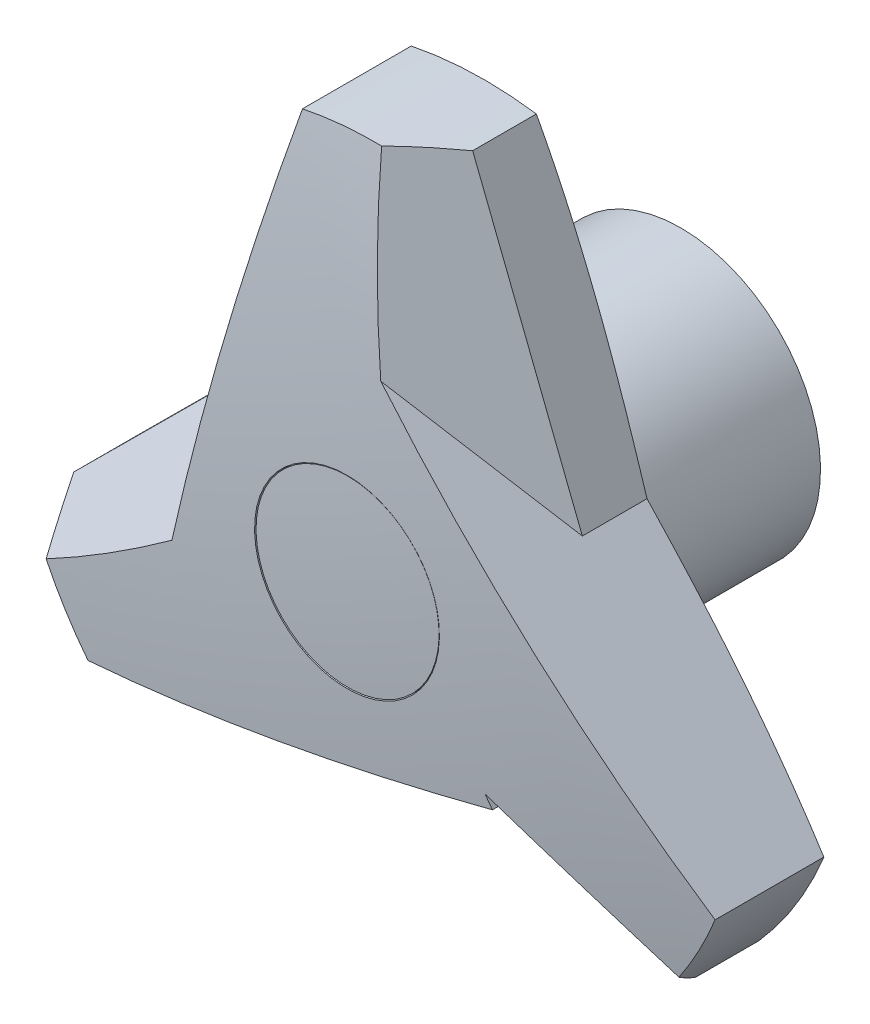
ISO-10303-21;
HEADER;
FILE_DESCRIPTION(('STEP AP214'),'2;1');
FILE_NAME('part.step','',(''),(''),'','','');
FILE_SCHEMA(('AUTOMOTIVE_DESIGN { 1 0 10303 214 1 1 1 1 }'));
ENDSEC;
DATA;
#1=APPLICATION_CONTEXT('core data for automotive mechanical design processes');
#2=APPLICATION_PROTOCOL_DEFINITION('international standard','automotive_design',2000,#1);
#3=PRODUCT_CONTEXT('',#1,'mechanical');
#4=PRODUCT('Part','Part','',(#3));
#5=PRODUCT_RELATED_PRODUCT_CATEGORY('part','',(#4));
#6=PRODUCT_DEFINITION_FORMATION('','',#4);
#7=PRODUCT_DEFINITION_CONTEXT('part definition',#1,'design');
#8=PRODUCT_DEFINITION('design','',#6,#7);
#9=PRODUCT_DEFINITION_SHAPE('','',#8);
#10=(LENGTH_UNIT() NAMED_UNIT(*) SI_UNIT(.MILLI.,.METRE.));
#11=(NAMED_UNIT(*) PLANE_ANGLE_UNIT() SI_UNIT($,.RADIAN.));
#12=(NAMED_UNIT(*) SI_UNIT($,.STERADIAN.) SOLID_ANGLE_UNIT());
#13=UNCERTAINTY_MEASURE_WITH_UNIT(LENGTH_MEASURE(1.E-05),#10,'distance_accuracy_value','');
#14=(GEOMETRIC_REPRESENTATION_CONTEXT(3) GLOBAL_UNCERTAINTY_ASSIGNED_CONTEXT((#13)) GLOBAL_UNIT_ASSIGNED_CONTEXT((#10,
#11,#12)) REPRESENTATION_CONTEXT('',''));
#15=CARTESIAN_POINT('',(0.,0.,0.));
#16=DIRECTION('',(0.,0.,1.));
#17=DIRECTION('',(1.,0.,0.));
#18=AXIS2_PLACEMENT_3D('',#15,#16,#17);
#19=CARTESIAN_POINT('',(0.,0.,199.590651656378));
#20=DIRECTION('',(0.,0.,-1.));
#21=DIRECTION('',(0.,1.,0.));
#22=AXIS2_PLACEMENT_3D('',#19,#20,#21);
#23=DEGENERATE_TOROIDAL_SURFACE('',#22,12.1325115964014,179.999999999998,.T.);
#24=CARTESIAN_POINT('',(0.,0.,21.7609491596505));
#25=DIRECTION('',(0.,0.,1.));
#26=DIRECTION('',(0.,-1.,0.));
#27=AXIS2_PLACEMENT_3D('',#24,#25,#26);
#28=CIRCLE('',#27,40.);
#29=CARTESIAN_POINT('',(5.66240415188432,39.5971865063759,21.7609491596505));
#30=VERTEX_POINT('',#29);
#31=CARTESIAN_POINT('',(-8.00833046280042,39.1901345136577,21.7609491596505));
#32=VERTEX_POINT('',#31);
#33=EDGE_CURVE('E116',#30,#32,#28,.T.);
#34=ORIENTED_EDGE('',*,*,#33,.F.);
#35=CARTESIAN_POINT('',(15.6512103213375,7.13356645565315,19.662004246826));
#36=CARTESIAN_POINT('',(15.4401686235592,7.8194519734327,19.6646388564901));
#37=CARTESIAN_POINT('',(15.2291275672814,8.50533540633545,19.6685241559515));
#38=CARTESIAN_POINT('',(14.8070497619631,9.87708827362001,19.6793435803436));
#39=CARTESIAN_POINT('',(14.5960130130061,10.5629577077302,19.6862777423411));
#40=CARTESIAN_POINT('',(14.1739312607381,11.9347234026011,19.7037431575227));
#41=CARTESIAN_POINT('',(13.9628862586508,12.6206196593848,19.7142747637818));
#42=CARTESIAN_POINT('',(13.540818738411,13.9923391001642,19.7396036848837));
#43=CARTESIAN_POINT('',(13.3297962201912,14.6781622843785,19.7544009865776));
#44=CARTESIAN_POINT('',(12.908133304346,16.0485667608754,19.7888864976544));
#45=CARTESIAN_POINT('',(12.6974928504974,16.7331482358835,19.8085666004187));
#46=CARTESIAN_POINT('',(12.2762631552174,18.1021447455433,19.8534225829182));
#47=CARTESIAN_POINT('',(12.0656739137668,18.7865597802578,19.8785984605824));
#48=CARTESIAN_POINT('',(11.4340161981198,20.8394473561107,19.9631760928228));
#49=CARTESIAN_POINT('',(11.0130466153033,22.2075985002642,20.0316286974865));
#50=CARTESIAN_POINT('',(10.3164758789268,24.4714533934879,20.1675775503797));
#51=CARTESIAN_POINT('',(10.0407419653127,25.3675886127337,20.2272837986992));
#52=CARTESIAN_POINT('',(9.48953016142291,27.1590269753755,20.359048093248));
#53=CARTESIAN_POINT('',(9.21405227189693,28.054330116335,20.4311061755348));
#54=CARTESIAN_POINT('',(8.38808305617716,30.7387300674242,20.6665756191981));
#55=CARTESIAN_POINT('',(7.83804915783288,32.5263402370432,20.8492835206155));
#56=CARTESIAN_POINT('',(7.01378032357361,35.2052139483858,21.164017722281));
#57=CARTESIAN_POINT('',(6.73886374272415,36.0986928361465,21.2758478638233));
#58=CARTESIAN_POINT('',(6.18954079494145,37.8839924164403,21.51322997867));
#59=CARTESIAN_POINT('',(5.91513442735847,38.775813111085,21.6387819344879));
#60=CARTESIAN_POINT('',(5.36688101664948,40.5576366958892,21.9037708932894));
#61=CARTESIAN_POINT('',(5.09303401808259,41.4476394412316,22.0432089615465));
#62=CARTESIAN_POINT('',(4.54598520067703,43.2255480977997,22.3360608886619));
#63=CARTESIAN_POINT('',(4.2727833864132,44.1134539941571,22.489474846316));
#64=CARTESIAN_POINT('',(3.99993846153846,45.0002,22.6499251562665));
#65=B_SPLINE_CURVE_WITH_KNOTS('',3,(#35,#36,#37,#38,#39,#40,#41,#42,#43,#44,#45,#46,#47,#48,#49,
#50,#51,#52,#53,#54,#55,#56,#57,#58,#59,#60,#61,#62,#63,#64),.UNSPECIFIED.,.F.,.F.,(4,2,2,2,2,2,
2,2,2,2,2,2,2,2,4),(0.,2.15287507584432,4.30577632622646,6.45888893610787,8.61199490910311,
10.7615498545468,12.9111039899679,17.2100988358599,20.0285093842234,22.846928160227,
28.4836939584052,31.308063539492,34.1324295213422,36.9570123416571,39.7816151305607),.UNSPECIFIED.);
#66=CARTESIAN_POINT('',(15.6511487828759,7.13376645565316,19.6620050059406));
#67=VERTEX_POINT('',#66);
#68=EDGE_CURVE('E132',#67,#30,#65,.T.);
#69=ORIENTED_EDGE('',*,*,#68,.F.);
#70=CARTESIAN_POINT('',(40.9713431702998,-19.0361050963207,22.6499391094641));
#71=CARTESIAN_POINT('',(40.3665233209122,-18.4109891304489,22.4983062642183));
#72=CARTESIAN_POINT('',(39.7609596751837,-17.785104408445,22.3528792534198));
#73=CARTESIAN_POINT('',(38.5484646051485,-16.5319212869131,22.0743693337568));
#74=CARTESIAN_POINT('',(37.9415331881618,-15.9046228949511,21.9412863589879));
#75=CARTESIAN_POINT('',(36.1189517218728,-14.0208805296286,21.5604695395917));
#76=CARTESIAN_POINT('',(34.9014204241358,-12.7624921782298,21.3311442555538));
#77=CARTESIAN_POINT('',(32.464670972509,-10.2439720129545,20.9210416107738));
#78=CARTESIAN_POINT('',(31.24545992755,-8.98384754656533,20.7401766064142));
#79=CARTESIAN_POINT('',(29.4145124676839,-7.09145844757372,20.5035597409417));
#80=CARTESIAN_POINT('',(28.8038351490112,-6.46028845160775,20.4304669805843));
#81=CARTESIAN_POINT('',(27.5818825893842,-5.19733047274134,20.2954943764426));
#82=CARTESIAN_POINT('',(26.9706073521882,-4.56554249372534,20.2336144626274));
#83=CARTESIAN_POINT('',(25.7490545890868,-3.30299772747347,20.1207675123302));
#84=CARTESIAN_POINT('',(25.1387782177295,-2.67224213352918,20.069774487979));
#85=CARTESIAN_POINT('',(23.9178580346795,-1.41035117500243,19.9779346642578));
#86=CARTESIAN_POINT('',(23.3072142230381,-0.779215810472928,19.9370878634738));
#87=CARTESIAN_POINT('',(22.0856544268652,0.483336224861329,19.8647872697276));
#88=CARTESIAN_POINT('',(21.4747384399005,1.11475289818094,19.8333335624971));
#89=CARTESIAN_POINT('',(20.2527270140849,2.37777171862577,19.7788579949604));
#90=CARTESIAN_POINT('',(19.6416315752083,3.0093738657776,19.7558361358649));
#91=CARTESIAN_POINT('',(18.4191107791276,4.27291914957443,19.7170407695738));
#92=CARTESIAN_POINT('',(17.8076853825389,4.90486232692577,19.7012698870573));
#93=CARTESIAN_POINT('',(16.584775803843,6.16880943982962,19.67565248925));
#94=CARTESIAN_POINT('',(15.9732916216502,6.80081337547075,19.6658059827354));
#95=CARTESIAN_POINT('',(14.7503004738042,8.06484479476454,19.65071439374));
#96=CARTESIAN_POINT('',(14.1387935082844,8.69687227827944,19.6454692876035));
#97=CARTESIAN_POINT('',(12.9157713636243,9.96093573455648,19.6385540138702));
#98=CARTESIAN_POINT('',(12.3042561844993,10.5929717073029,19.63688384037));
#99=CARTESIAN_POINT('',(11.3320063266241,11.5978476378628,19.6367673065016));
#100=CARTESIAN_POINT('',(10.9712715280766,11.9706877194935,19.6372797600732));
#101=CARTESIAN_POINT('',(10.249805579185,12.7163641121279,19.6394704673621));
#102=CARTESIAN_POINT('',(9.88907442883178,13.089200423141,19.641148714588));
#103=CARTESIAN_POINT('',(9.16766569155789,13.8348176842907,19.6457974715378));
#104=CARTESIAN_POINT('',(8.80698810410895,14.2075986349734,19.6487678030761));
#105=CARTESIAN_POINT('',(8.08563989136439,14.9531533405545,19.6562018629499));
#106=CARTESIAN_POINT('',(7.72496926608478,15.3259270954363,19.6606655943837));
#107=CARTESIAN_POINT('',(6.64241534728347,16.4448085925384,19.6766781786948));
#108=CARTESIAN_POINT('',(5.92054808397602,17.1908997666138,19.6908455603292));
#109=CARTESIAN_POINT('',(4.47681743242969,18.6830781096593,19.7283493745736));
#110=CARTESIAN_POINT('',(3.75495406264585,19.429165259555,19.751687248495));
#111=CARTESIAN_POINT('',(3.03318673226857,20.1751531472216,19.7807036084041));
#112=B_SPLINE_CURVE_WITH_KNOTS('',3,(#70,#71,#72,#73,#74,#75,#76,#77,#78,#79,#80,#81,#82,#83,
#84,#85,#86,#87,#88,#89,#90,#91,#92,#93,#94,#95,#96,#97,#98,#99,#100,#101,#102,#103,#104,#105,
#106,#107,#108,#109,#110,#111),.UNSPECIFIED.,.F.,.F.,(4,2,2,2,2,2,2,2,2,2,2,2,2,2,2,2,2,2,2,2,
4),(0.,2.64875141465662,5.29748868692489,10.5945515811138,15.881968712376,18.5257321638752,
21.1694791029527,23.806842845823,26.4442062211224,29.0815936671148,31.7189814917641,
34.3573232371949,36.9956688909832,39.634000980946,42.2723287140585,43.8286875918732,
45.3850378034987,46.9411734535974,48.4973123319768,51.6119978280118,54.7271730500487),.UNSPECIFIED.);
#113=CARTESIAN_POINT('',(37.0766539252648,-15.0107206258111,21.7609491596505));
#114=VERTEX_POINT('',#113);
#115=EDGE_CURVE('E131',#114,#67,#112,.T.);
#116=ORIENTED_EDGE('',*,*,#115,.F.);
#117=CARTESIAN_POINT('',(30.01202420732,-26.4438726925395,21.7609491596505));
#118=VERTEX_POINT('',#117);
#119=EDGE_CURVE('E23',#118,#114,#28,.T.);
#120=ORIENTED_EDGE('',*,*,#119,.F.);
#121=CARTESIAN_POINT('',(0.24616999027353,-17.6571983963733,19.6755081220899));
#122=CARTESIAN_POINT('',(0.952943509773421,-17.8658330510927,19.6822269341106));
#123=CARTESIAN_POINT('',(1.65970623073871,-18.0744645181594,19.6906171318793));
#124=CARTESIAN_POINT('',(3.07318774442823,-18.4917144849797,19.7114702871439));
#125=CARTESIAN_POINT('',(3.77990653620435,-18.7003329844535,19.7239333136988));
#126=CARTESIAN_POINT('',(5.19333378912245,-19.1175669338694,19.7536636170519));
#127=CARTESIAN_POINT('',(5.90004224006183,-19.3261823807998,19.7709314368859));
#128=CARTESIAN_POINT('',(7.31331115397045,-19.7433695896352,19.8109658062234));
#129=CARTESIAN_POINT('',(8.01987161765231,-19.9519413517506,19.8337323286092));
#130=CARTESIAN_POINT('',(10.1367780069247,-20.5768374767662,19.9111462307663));
#131=CARTESIAN_POINT('',(11.546833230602,-20.9930760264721,19.9749556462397));
#132=CARTESIAN_POINT('',(14.3654677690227,-21.8251174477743,20.1308457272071));
#133=CARTESIAN_POINT('',(15.7740471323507,-22.2409203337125,20.2229254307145));
#134=CARTESIAN_POINT('',(18.7331430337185,-23.1144249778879,20.4488258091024));
#135=CARTESIAN_POINT('',(20.2834301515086,-23.5720590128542,20.585954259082));
#136=CARTESIAN_POINT('',(23.3803585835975,-24.4862508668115,20.8996401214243));
#137=CARTESIAN_POINT('',(24.9269998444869,-24.9428086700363,21.0761981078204));
#138=CARTESIAN_POINT('',(28.0184621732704,-25.8553869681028,21.4703451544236));
#139=CARTESIAN_POINT('',(29.5632742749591,-26.3114048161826,21.6880111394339));
#140=CARTESIAN_POINT('',(31.8760480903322,-26.994119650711,22.0456557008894));
#141=CARTESIAN_POINT('',(32.6462498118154,-27.2214778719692,22.1700647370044));
#142=CARTESIAN_POINT('',(34.1850389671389,-27.6757177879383,22.4293188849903));
#143=CARTESIAN_POINT('',(34.953626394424,-27.9025994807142,22.5641640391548));
#144=CARTESIAN_POINT('',(35.7213431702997,-28.1292241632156,22.7042542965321));
#145=B_SPLINE_CURVE_WITH_KNOTS('',3,(#121,#122,#123,#124,#125,#126,#127,#128,#129,#130,#131,
#132,#133,#134,#135,#136,#137,#138,#139,#140,#141,#142,#143,#144),.UNSPECIFIED.,.F.,.F.,(4,2,2,
2,2,2,2,2,2,2,2,4),(0.,2.21086830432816,4.42177409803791,6.63292986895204,8.84407473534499,
13.2585931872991,17.6729614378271,22.5391730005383,27.4054554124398,32.2809359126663,
34.7187894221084,37.1566528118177),.UNSPECIFIED.);
#146=CARTESIAN_POINT('',(0.24636999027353,-17.6572574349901,19.6755100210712));
#147=VERTEX_POINT('',#146);
#148=EDGE_CURVE('E129',#147,#118,#145,.T.);
#149=ORIENTED_EDGE('',*,*,#148,.F.);
#150=CARTESIAN_POINT('',(-36.9713431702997,-25.9641462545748,22.6499243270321));
#151=CARTESIAN_POINT('',(-36.0494174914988,-25.7583750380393,22.4869301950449));
#152=CARTESIAN_POINT('',(-35.1262668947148,-25.5523304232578,22.331223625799));
#153=CARTESIAN_POINT('',(-33.2777590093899,-25.139748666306,22.0342783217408));
#154=CARTESIAN_POINT('',(-32.352401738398,-24.9332115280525,21.8930394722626));
#155=CARTESIAN_POINT('',(-30.4997864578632,-24.519713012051,21.6249309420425));
#156=CARTESIAN_POINT('',(-29.5725286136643,-24.3127516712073,21.4980600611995));
#157=CARTESIAN_POINT('',(-27.7162677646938,-23.8984394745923,21.258510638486));
#158=CARTESIAN_POINT('',(-26.7872647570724,-23.6910886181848,21.14583211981));
#159=CARTESIAN_POINT('',(-24.9294076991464,-23.2764201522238,20.934637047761));
#160=CARTESIAN_POINT('',(-24.0005563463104,-23.0691031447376,20.8360955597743));
#161=CARTESIAN_POINT('',(-22.1415722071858,-22.6541831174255,20.6526398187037));
#162=CARTESIAN_POINT('',(-21.2114394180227,-22.446580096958,20.5677255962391));
#163=CARTESIAN_POINT('',(-19.3501244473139,-22.031139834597,20.4111280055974));
#164=CARTESIAN_POINT('',(-18.4189422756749,-21.8233025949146,20.3394445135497));
#165=CARTESIAN_POINT('',(-16.5557324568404,-21.4074394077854,20.2087759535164));
#166=CARTESIAN_POINT('',(-15.6237048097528,-21.1994134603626,20.1497908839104));
#167=CARTESIAN_POINT('',(-13.7615093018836,-20.7837766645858,20.0439561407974));
#168=CARTESIAN_POINT('',(-12.8313431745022,-20.5761662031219,19.997074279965));
#169=CARTESIAN_POINT('',(-10.9705482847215,-20.1608420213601,19.9143245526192));
#170=CARTESIAN_POINT('',(-10.0399195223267,-19.9531283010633,19.8784566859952));
#171=CARTESIAN_POINT('',(-8.17832924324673,-19.5376265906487,19.816573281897));
#172=CARTESIAN_POINT('',(-7.24736771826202,-19.3298385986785,19.7905580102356));
#173=CARTESIAN_POINT('',(-5.38525964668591,-18.9142213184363,19.7469845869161));
#174=CARTESIAN_POINT('',(-4.45411309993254,-18.7063920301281,19.7294264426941));
#175=CARTESIAN_POINT('',(-2.59141797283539,-18.2906437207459,19.7012365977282));
#176=CARTESIAN_POINT('',(-1.65986936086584,-18.0827246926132,19.6906071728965));
#177=CARTESIAN_POINT('',(0.203271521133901,-17.6668768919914,19.6748789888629));
#178=CARTESIAN_POINT('',(1.13486379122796,-17.4589481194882,19.6697802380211));
#179=CARTESIAN_POINT('',(2.99803990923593,-17.0430924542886,19.6642045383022));
#180=CARTESIAN_POINT('',(3.92962375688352,-16.8351655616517,19.6637274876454));
#181=CARTESIAN_POINT('',(5.79278090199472,-16.4193141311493,19.667296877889));
#182=CARTESIAN_POINT('',(6.72435419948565,-16.2113895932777,19.6713433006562));
#183=CARTESIAN_POINT('',(7.9700728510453,-15.9333486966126,19.680287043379));
#184=CARTESIAN_POINT('',(8.2842348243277,-15.8632286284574,19.6828430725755));
#185=CARTESIAN_POINT('',(8.91255254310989,-15.7229898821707,19.6886064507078));
#186=CARTESIAN_POINT('',(9.22670828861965,-15.6528712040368,19.6918137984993));
#187=CARTESIAN_POINT('',(10.1691070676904,-15.4425304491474,19.7024849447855));
#188=CARTESIAN_POINT('',(10.7973392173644,-15.3023108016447,19.7109982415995));
#189=CARTESIAN_POINT('',(12.0540495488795,-15.0218165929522,19.7312785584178));
#190=CARTESIAN_POINT('',(12.6825277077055,-14.8815420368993,19.743047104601));
#191=CARTESIAN_POINT('',(13.9394722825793,-14.6009955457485,19.770301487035));
#192=CARTESIAN_POINT('',(14.5679386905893,-14.4607236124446,19.7857877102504));
#193=CARTESIAN_POINT('',(15.1963524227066,-14.3204634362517,19.8033642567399));
#194=B_SPLINE_CURVE_WITH_KNOTS('',3,(#150,#151,#152,#153,#154,#155,#156,#157,#158,#159,#160,
#161,#162,#163,#164,#165,#166,#167,#168,#169,#170,#171,#172,#173,#174,#175,#176,#177,#178,#179,
#180,#181,#182,#183,#184,#185,#186,#187,#188,#189,#190,#191,#192,#193),.UNSPECIFIED.,.F.,.F.,(4,
2,2,2,2,2,2,2,2,2,2,2,2,2,2,2,2,2,2,2,2,4),(0.,2.87567705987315,5.75133132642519,
8.62674522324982,11.5021638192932,14.3724467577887,17.2427361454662,20.1129986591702,
22.9832608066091,25.8458092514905,28.7083576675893,31.5709833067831,34.4336114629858,
37.2971794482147,40.1607517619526,43.0242610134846,45.8877587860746,46.8534652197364,
47.8191699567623,49.750402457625,51.6825419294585,53.6148826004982),.UNSPECIFIED.);
#195=CARTESIAN_POINT('',(-31.4396613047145,-24.7294904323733,21.7609491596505));
#196=VERTEX_POINT('',#195);
#197=EDGE_CURVE('E121',#196,#147,#194,.T.);
#198=ORIENTED_EDGE('',*,*,#197,.F.);
#199=CARTESIAN_POINT('',(-37.9539072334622,-12.62936758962,21.7609491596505));
#200=VERTEX_POINT('',#199);
#201=EDGE_CURVE('E107',#200,#196,#28,.T.);
#202=ORIENTED_EDGE('',*,*,#201,.F.);
#203=CARTESIAN_POINT('',(-15.7252762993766,9.46503082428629,19.6982047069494));
#204=CARTESIAN_POINT('',(-16.8118399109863,8.38502866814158,19.7111482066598));
#205=CARTESIAN_POINT('',(-17.8984171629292,7.30501295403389,19.7313884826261));
#206=CARTESIAN_POINT('',(-20.0714174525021,5.1451348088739,19.7921582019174));
#207=CARTESIAN_POINT('',(-21.157840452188,4.06527241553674,19.8326902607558));
#208=CARTESIAN_POINT('',(-23.3281246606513,1.90809394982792,19.9396428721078));
#209=CARTESIAN_POINT('',(-24.4119869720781,0.830776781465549,20.0060169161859));
#210=CARTESIAN_POINT('',(-26.5785433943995,-1.3226964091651,20.1688513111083));
#211=CARTESIAN_POINT('',(-27.6612375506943,-2.39885247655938,20.2653104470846));
#212=CARTESIAN_POINT('',(-29.8709603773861,-4.59523140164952,20.4959357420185));
#213=CARTESIAN_POINT('',(-30.9979146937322,-5.7153803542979,20.6315320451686));
#214=CARTESIAN_POINT('',(-33.2492333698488,-7.95310394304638,20.9405112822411));
#215=CARTESIAN_POINT('',(-34.3735976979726,-9.07067854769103,21.1138946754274));
#216=CARTESIAN_POINT('',(-36.621020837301,-11.3045301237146,21.5000504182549));
#217=CARTESIAN_POINT('',(-37.7440735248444,-12.4208010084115,21.7128940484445));
#218=CARTESIAN_POINT('',(-39.4255164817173,-14.092090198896,22.062105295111));
#219=CARTESIAN_POINT('',(-39.9854881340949,-14.6486803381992,22.1835032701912));
#220=CARTESIAN_POINT('',(-41.1042923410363,-15.7607283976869,22.4363398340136));
#221=CARTESIAN_POINT('',(-41.6631248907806,-16.3161863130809,22.5677784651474));
#222=CARTESIAN_POINT('',(-42.2213431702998,-16.8710336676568,22.7042667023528));
#223=B_SPLINE_CURVE_WITH_KNOTS('',3,(#203,#204,#205,#206,#207,#208,#209,#210,#211,#212,#213,
#214,#215,#216,#217,#218,#219,#220,#221,#222),.UNSPECIFIED.,.F.,.F.,(4,2,2,2,2,2,2,2,2,4),(0.,
4.59627170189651,9.19313599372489,13.7817651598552,18.3702090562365,23.1539456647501,
27.9377404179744,32.7302622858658,35.1266377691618,37.5230233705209),.UNSPECIFIED.);
#224=CARTESIAN_POINT('',(-15.7254762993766,9.46483203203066,19.6982070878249));
#225=VERTEX_POINT('',#224);
#226=EDGE_CURVE('E117',#225,#200,#223,.T.);
#227=ORIENTED_EDGE('',*,*,#226,.F.);
#228=CARTESIAN_POINT('',(-6.49994807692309,45.0002,22.7042537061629));
#229=CARTESIAN_POINT('',(-6.73884887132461,44.0799895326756,22.5390487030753));
#230=CARTESIAN_POINT('',(-6.97807127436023,43.1585402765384,22.381223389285));
#231=CARTESIAN_POINT('',(-7.4570954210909,41.3134102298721,22.0802218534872));
#232=CARTESIAN_POINT('',(-7.69689716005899,40.3897294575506,21.937045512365));
#233=CARTESIAN_POINT('',(-8.1769990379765,38.5404481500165,21.6652408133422));
#234=CARTESIAN_POINT('',(-8.41729913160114,37.6148477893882,21.5366111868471));
#235=CARTESIAN_POINT('',(-8.89835749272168,35.7618822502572,21.2937179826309));
#236=CARTESIAN_POINT('',(-9.13911576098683,34.8345170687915,21.1794544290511));
#237=CARTESIAN_POINT('',(-9.62060501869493,32.9798917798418,20.9652574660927));
#238=CARTESIAN_POINT('',(-9.86133531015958,32.0526343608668,20.8652991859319));
#239=CARTESIAN_POINT('',(-10.3431323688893,30.196823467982,20.6791714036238));
#240=CARTESIAN_POINT('',(-10.584199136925,29.2682699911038,20.5930019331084));
#241=CARTESIAN_POINT('',(-11.0666085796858,27.4101002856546,20.4340470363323));
#242=CARTESIAN_POINT('',(-11.3079512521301,26.4804840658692,20.3612615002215));
#243=CARTESIAN_POINT('',(-11.7908587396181,24.6203959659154,20.2285326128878));
#244=CARTESIAN_POINT('',(-12.0324235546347,23.6899240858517,20.1685892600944));
#245=CARTESIAN_POINT('',(-12.5150600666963,21.8308797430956,20.0609771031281));
#246=CARTESIAN_POINT('',(-12.7561312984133,20.9023090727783,20.0132750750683));
#247=CARTESIAN_POINT('',(-13.2383956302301,19.044698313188,19.9290082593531));
#248=CARTESIAN_POINT('',(-13.4795887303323,18.1156582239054,19.8924434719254));
#249=CARTESIAN_POINT('',(-13.9620627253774,16.2572398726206,19.8292860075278));
#250=CARTESIAN_POINT('',(-14.2033436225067,15.3278616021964,19.8026935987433));
#251=CARTESIAN_POINT('',(-14.6859546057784,13.4689155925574,19.7580926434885));
#252=CARTESIAN_POINT('',(-14.927284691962,12.5393478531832,19.7400841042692));
#253=CARTESIAN_POINT('',(-15.4100471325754,10.6798184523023,19.7111431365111));
#254=CARTESIAN_POINT('',(-15.6514794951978,9.74985675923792,19.7002129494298));
#255=CARTESIAN_POINT('',(-16.134356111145,7.88988757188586,19.6840721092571));
#256=CARTESIAN_POINT('',(-16.3758003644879,6.95988007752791,19.6788614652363));
#257=CARTESIAN_POINT('',(-16.8586865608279,5.0998739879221,19.6732953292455));
#258=CARTESIAN_POINT('',(-17.1001285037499,4.16987539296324,19.6729397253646));
#259=CARTESIAN_POINT('',(-17.583009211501,2.30989044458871,19.6770158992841));
#260=CARTESIAN_POINT('',(-17.8244479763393,1.37990409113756,19.6814476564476));
#261=CARTESIAN_POINT('',(-18.1390784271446,0.167994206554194,19.6908393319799));
#262=CARTESIAN_POINT('',(-18.2122750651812,-0.113948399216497,19.6932793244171));
#263=CARTESIAN_POINT('',(-18.3586669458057,-0.677828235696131,19.6987059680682));
#264=CARTESIAN_POINT('',(-18.4318621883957,-0.959765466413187,19.7016926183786));
#265=CARTESIAN_POINT('',(-18.6514333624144,-1.80552109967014,19.7115232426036));
#266=CARTESIAN_POINT('',(-18.7978069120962,-2.36933032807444,19.7192382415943));
#267=CARTESIAN_POINT('',(-19.0906069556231,-3.4971527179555,19.7373119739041));
#268=CARTESIAN_POINT('',(-19.2370334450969,-4.06116586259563,19.7476718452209));
#269=CARTESIAN_POINT('',(-19.5298847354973,-5.18918564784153,19.7713676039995));
#270=CARTESIAN_POINT('',(-19.6763095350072,-5.75319228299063,19.784703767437));
#271=CARTESIAN_POINT('',(-19.8227241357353,-6.31715963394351,19.799694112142));
#272=B_SPLINE_CURVE_WITH_KNOTS('',3,(#228,#229,#230,#231,#232,#233,#234,#235,#236,#237,#238,
#239,#240,#241,#242,#243,#244,#245,#246,#247,#248,#249,#250,#251,#252,#253,#254,#255,#256,#257,
#258,#259,#260,#261,#262,#263,#264,#265,#266,#267,#268,#269,#270,#271),.UNSPECIFIED.,.F.,.F.,(4,
2,2,2,2,2,2,2,2,2,2,2,2,2,2,2,2,2,2,2,2,4),(0.,2.89485634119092,5.78968914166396,
8.68426929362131,11.5788543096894,14.4683440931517,17.3578405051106,20.2473132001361,
23.1367855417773,26.018330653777,28.8998758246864,31.7814984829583,34.6631235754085,
37.5456607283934,40.42820245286,43.3106777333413,46.1931405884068,47.0670383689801,
47.9409347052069,49.6885820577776,51.4369826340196,53.1855453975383),.UNSPECIFIED.);
#273=EDGE_CURVE('E136',#32,#225,#272,.T.);
#274=ORIENTED_EDGE('',*,*,#273,.F.);
#275=EDGE_LOOP('',(#34,#69,#116,#120,#149,#198,#202,#227,#274));
#276=FACE_BOUND('',#275,.T.);
#277=CARTESIAN_POINT('',(0.,0.,19.617650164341));
#278=DIRECTION('',(0.,0.,1.));
#279=DIRECTION('',(0.,-1.,0.));
#280=AXIS2_PLACEMENT_3D('',#277,#278,#279);
#281=CIRCLE('',#280,15.25);
#282=CARTESIAN_POINT('',(0.,-15.25,19.617650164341));
#283=VERTEX_POINT('',#282);
#284=EDGE_CURVE('E9',#283,#283,#281,.T.);
#285=ORIENTED_EDGE('',*,*,#284,.T.);
#286=EDGE_LOOP('',(#285));
#287=FACE_BOUND('',#286,.T.);
#288=ADVANCED_FACE('F14',(#276,#287),#23,.T.);
#289=CARTESIAN_POINT('',(-7.34034254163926,-20.6475774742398,21.5514978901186));
#290=DIRECTION('',(-0.238823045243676,-0.671782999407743,0.70119266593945));
#291=DIRECTION('',(0.,-0.722087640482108,-0.691801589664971));
#292=AXIS2_PLACEMENT_3D('',#289,#290,#291);
#293=PLANE('',#292);
#294=CARTESIAN_POINT('',(0.,0.,43.833154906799));
#295=DIRECTION('',(-0.238823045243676,-0.671782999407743,0.70119266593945));
#296=DIRECTION('',(-0.23487739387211,-0.660684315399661,-0.712971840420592));
#297=AXIS2_PLACEMENT_3D('',#294,#295,#296);
#298=ELLIPSE('',#297,57.0456622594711,40.);
#299=CARTESIAN_POINT('',(33.1301983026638,-22.414057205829,33.6431913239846));
#300=VERTEX_POINT('',#299);
#301=CARTESIAN_POINT('',(30.01202420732,-26.4438726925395,28.720359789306));
#302=VERTEX_POINT('',#301);
#303=EDGE_CURVE('E185',#300,#302,#298,.F.);
#304=ORIENTED_EDGE('',*,*,#303,.F.);
#305=CARTESIAN_POINT('',(-41.3349190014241,-116.270587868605,-81.6392576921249));
#306=DIRECTION('',(-0.238823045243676,-0.671782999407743,0.70119266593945));
#307=DIRECTION('',(0.,-0.722087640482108,-0.691801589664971));
#308=AXIS2_PLACEMENT_3D('',#305,#306,#307);
#309=CIRCLE('',#308,166.265285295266);
#310=CARTESIAN_POINT('',(14.5041157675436,-13.1218654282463,36.201687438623));
#311=VERTEX_POINT('',#310);
#312=EDGE_CURVE('E482',#300,#311,#309,.T.);
#313=ORIENTED_EDGE('',*,*,#312,.T.);
#314=DIRECTION('',(0.417418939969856,-0.722990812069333,-0.550495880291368));
#315=VECTOR('',#314,1.);
#316=CARTESIAN_POINT('',(16.3355827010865,-16.294059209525,33.7863322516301));
#317=LINE('',#316,#315);
#318=CARTESIAN_POINT('',(15.1961524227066,-14.3205080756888,35.2890232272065));
#319=VERTEX_POINT('',#318);
#320=EDGE_CURVE('E497',#311,#319,#317,.T.);
#321=ORIENTED_EDGE('',*,*,#320,.T.);
#322=DIRECTION('',(0.858373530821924,0.191586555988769,0.475909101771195));
#323=VECTOR('',#322,1.);
#324=CARTESIAN_POINT('',(-8.06124280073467,-19.5114932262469,22.3943967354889));
#325=LINE('',#324,#323);
#326=CARTESIAN_POINT('',(0.246369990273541,-17.6572574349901,27.0003968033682));
#327=VERTEX_POINT('',#326);
#328=EDGE_CURVE('E492',#327,#319,#325,.T.);
#329=ORIENTED_EDGE('',*,*,#328,.F.);
#330=DIRECTION('',(0.957616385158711,-0.282681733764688,0.0553344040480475));
#331=VECTOR('',#330,1.);
#332=CARTESIAN_POINT('',(-19.5262794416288,-11.8205080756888,25.857864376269));
#333=LINE('',#332,#331);
#334=EDGE_CURVE('E499',#327,#302,#333,.T.);
#335=ORIENTED_EDGE('',*,*,#334,.T.);
#336=EDGE_LOOP('',(#304,#313,#321,#329,#335));
#337=FACE_BOUND('',#336,.T.);
#338=ADVANCED_FACE('F163',(#337),#293,.T.);
#339=CARTESIAN_POINT('',(21.4172553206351,5.27507486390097,21.417255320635));
#340=DIRECTION('',(0.696620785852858,0.171577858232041,0.696620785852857));
#341=DIRECTION('',(-0.707106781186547,0.,0.707106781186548));
#342=AXIS2_PLACEMENT_3D('',#339,#340,#341);
#343=PLANE('',#342);
#344=CARTESIAN_POINT('',(0.,0.,44.1337627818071));
#345=DIRECTION('',(0.696620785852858,0.171577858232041,0.696620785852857));
#346=DIRECTION('',(0.676406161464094,0.166598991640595,-0.717439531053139));
#347=AXIS2_PLACEMENT_3D('',#344,#345,#346);
#348=ELLIPSE('',#347,57.4200494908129,40.);
#349=CARTESIAN_POINT('',(0.639822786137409,39.9948825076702,33.6431913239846));
#350=VERTEX_POINT('',#349);
#351=CARTESIAN_POINT('',(5.66240415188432,39.5971865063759,28.7185625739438));
#352=VERTEX_POINT('',#351);
#353=EDGE_CURVE('E191',#350,#352,#348,.F.);
#354=ORIENTED_EDGE('',*,*,#353,.F.);
#355=CARTESIAN_POINT('',(119.929200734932,29.5385894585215,-83.0707992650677));
#356=DIRECTION('',(0.696620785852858,0.171577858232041,0.696620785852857));
#357=DIRECTION('',(-0.707106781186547,0.,0.707106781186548));
#358=AXIS2_PLACEMENT_3D('',#355,#356,#357);
#359=CIRCLE('',#358,167.216761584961);
#360=CARTESIAN_POINT('',(3.03338673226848,20.1749464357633,36.131282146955));
#361=VERTEX_POINT('',#360);
#362=EDGE_CURVE('E474',#350,#361,#359,.T.);
#363=ORIENTED_EDGE('',*,*,#362,.T.);
#364=DIRECTION('',(-0.617341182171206,0.638057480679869,0.46018747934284));
#365=VECTOR('',#364,1.);
#366=CARTESIAN_POINT('',(20.0888596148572,2.54713806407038,23.4175424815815));
#367=LINE('',#366,#365);
#368=CARTESIAN_POINT('',(15.6511487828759,7.13376645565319,26.7255656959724));
#369=VERTEX_POINT('',#368);
#370=EDGE_CURVE('E502',#369,#361,#367,.T.);
#371=ORIENTED_EDGE('',*,*,#370,.F.);
#372=DIRECTION('',(0.293580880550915,-0.954137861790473,-0.0585765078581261));
#373=VECTOR('',#372,1.);
#374=CARTESIAN_POINT('',(4.,45.,29.0502525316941));
#375=LINE('',#374,#373);
#376=EDGE_CURVE('E508',#352,#369,#375,.T.);
#377=ORIENTED_EDGE('',*,*,#376,.F.);
#378=EDGE_LOOP('',(#354,#363,#371,#377));
#379=FACE_BOUND('',#378,.T.);
#380=ADVANCED_FACE('F423',(#379),#343,.T.);
#381=CARTESIAN_POINT('',(-14.7668780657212,16.7343433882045,21.8758055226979));
#382=DIRECTION('',(-0.472518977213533,0.535475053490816,0.699994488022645));
#383=DIRECTION('',(0.,-0.79425644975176,0.607582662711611));
#384=AXIS2_PLACEMENT_3D('',#381,#382,#383);
#385=PLANE('',#384);
#386=CARTESIAN_POINT('',(0.,0.,44.6452041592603));
#387=DIRECTION('',(-0.472518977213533,0.535475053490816,0.699994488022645));
#388=DIRECTION('',(-0.463154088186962,0.524862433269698,-0.714148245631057));
#389=AXIS2_PLACEMENT_3D('',#386,#387,#388);
#390=ELLIPSE('',#389,57.1433071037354,40.);
#391=CARTESIAN_POINT('',(-36.017088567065,-17.4002681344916,33.6431913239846));
#392=VERTEX_POINT('',#391);
#393=CARTESIAN_POINT('',(-37.9539072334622,-12.62936758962,28.6861782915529));
#394=VERTEX_POINT('',#393);
#395=EDGE_CURVE('E125',#392,#394,#390,.F.);
#396=ORIENTED_EDGE('',*,*,#395,.F.);
#397=CARTESIAN_POINT('',(-81.9112960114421,92.8247493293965,-81.6557609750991));
#398=DIRECTION('',(-0.472518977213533,0.535475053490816,0.699994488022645));
#399=DIRECTION('',(0.,-0.79425644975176,0.607582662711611));
#400=AXIS2_PLACEMENT_3D('',#397,#398,#399);
#401=CIRCLE('',#400,165.980966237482);
#402=CARTESIAN_POINT('',(-19.8226722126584,-6.31695963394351,36.0965446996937));
#403=VERTEX_POINT('',#402);
#404=EDGE_CURVE('E469',#392,#403,#401,.T.);
#405=ORIENTED_EDGE('',*,*,#404,.T.);
#406=DIRECTION('',(0.218235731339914,0.840611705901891,-0.49572686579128));
#407=VECTOR('',#406,1.);
#408=CARTESIAN_POINT('',(-13.8146092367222,16.8252088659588,22.4491084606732));
#409=LINE('',#408,#407);
#410=CARTESIAN_POINT('',(-15.7254762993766,9.46483203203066,26.789681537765));
#411=VERTEX_POINT('',#410);
#412=EDGE_CURVE('E495',#403,#411,#409,.T.);
#413=ORIENTED_EDGE('',*,*,#412,.T.);
#414=DIRECTION('',(-0.707950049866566,-0.703674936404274,0.0604012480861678));
#415=VECTOR('',#414,1.);
#416=CARTESIAN_POINT('',(-4.80384757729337,20.3205080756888,25.857864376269));
#417=LINE('',#416,#415);
#418=EDGE_CURVE('E489',#411,#394,#417,.T.);
#419=ORIENTED_EDGE('',*,*,#418,.T.);
#420=EDGE_LOOP('',(#396,#405,#413,#419));
#421=FACE_BOUND('',#420,.T.);
#422=ADVANCED_FACE('F414',(#421),#385,.T.);
#423=CARTESIAN_POINT('',(-17.0345604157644,4.42243395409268,0.));
#424=DIRECTION('',(-0.967913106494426,0.251285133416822,0.));
#425=DIRECTION('',(-0.251285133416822,-0.967913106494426,0.));
#426=AXIS2_PLACEMENT_3D('',#423,#424,#425);
#427=PLANE('',#426);
#428=DIRECTION('',(0.,0.,-1.));
#429=VECTOR('',#428,1.);
#430=CARTESIAN_POINT('',(-8.00833046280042,39.1901345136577,37.));
#431=LINE('',#430,#429);
#432=CARTESIAN_POINT('',(-8.00833046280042,39.1901345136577,33.6431913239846));
#433=VERTEX_POINT('',#432);
#434=EDGE_CURVE('E193',#32,#433,#431,.F.);
#435=ORIENTED_EDGE('',*,*,#434,.F.);
#436=ORIENTED_EDGE('',*,*,#273,.T.);
#437=DIRECTION('',(0.,0.,-1.));
#438=VECTOR('',#437,1.);
#439=CARTESIAN_POINT('',(-15.7254762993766,9.46483203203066,0.));
#440=LINE('',#439,#438);
#441=EDGE_CURVE('E512',#411,#225,#440,.T.);
#442=ORIENTED_EDGE('',*,*,#441,.F.);
#443=ORIENTED_EDGE('',*,*,#412,.F.);
#444=CARTESIAN_POINT('',(-17.0345604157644,4.42243395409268,-203.));
#445=DIRECTION('',(-0.967913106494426,0.251285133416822,0.));
#446=DIRECTION('',(-0.251285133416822,-0.967913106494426,0.));
#447=AXIS2_PLACEMENT_3D('',#444,#445,#446);
#448=CIRCLE('',#447,239.353850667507);
#449=EDGE_CURVE('E471',#403,#433,#448,.T.);
#450=ORIENTED_EDGE('',*,*,#449,.T.);
#451=EDGE_LOOP('',(#435,#436,#442,#443,#450));
#452=FACE_BOUND('',#451,.T.);
#453=ADVANCED_FACE('F16',(#452),#427,.T.);
#454=CARTESIAN_POINT('',(11.6487168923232,11.2705091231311,0.));
#455=DIRECTION('',(0.718677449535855,0.695343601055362,0.));
#456=DIRECTION('',(-0.695343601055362,0.718677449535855,0.));
#457=AXIS2_PLACEMENT_3D('',#454,#455,#456);
#458=PLANE('',#457);
#459=DIRECTION('',(0.,0.,-1.));
#460=VECTOR('',#459,1.);
#461=CARTESIAN_POINT('',(37.0766539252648,-15.0107206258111,37.));
#462=LINE('',#461,#460);
#463=CARTESIAN_POINT('',(37.0766539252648,-15.0107206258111,33.6431913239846));
#464=VERTEX_POINT('',#463);
#465=EDGE_CURVE('E187',#114,#464,#462,.F.);
#466=ORIENTED_EDGE('',*,*,#465,.F.);
#467=ORIENTED_EDGE('',*,*,#115,.T.);
#468=DIRECTION('',(0.,0.,1.));
#469=VECTOR('',#468,1.);
#470=CARTESIAN_POINT('',(15.6511487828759,7.13376645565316,0.));
#471=LINE('',#470,#469);
#472=EDGE_CURVE('E505',#67,#369,#471,.T.);
#473=ORIENTED_EDGE('',*,*,#472,.T.);
#474=ORIENTED_EDGE('',*,*,#370,.T.);
#475=CARTESIAN_POINT('',(11.6487168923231,11.2705091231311,-203.));
#476=DIRECTION('',(0.718677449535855,0.695343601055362,0.));
#477=DIRECTION('',(-0.695343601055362,0.718677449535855,0.));
#478=AXIS2_PLACEMENT_3D('',#475,#476,#477);
#479=CIRCLE('',#478,239.452047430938);
#480=EDGE_CURVE('E479',#361,#464,#479,.T.);
#481=ORIENTED_EDGE('',*,*,#480,.T.);
#482=EDGE_LOOP('',(#466,#467,#473,#474,#481));
#483=FACE_BOUND('',#482,.T.);
#484=ADVANCED_FACE('F398',(#483),#458,.T.);
#485=CARTESIAN_POINT('',(3.76572643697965,-16.8717469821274,0.));
#486=DIRECTION('',(0.217837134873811,-0.975985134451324,0.));
#487=DIRECTION('',(0.975985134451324,0.217837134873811,0.));
#488=AXIS2_PLACEMENT_3D('',#485,#486,#487);
#489=PLANE('',#488);
#490=DIRECTION('',(0.,0.,-1.));
#491=VECTOR('',#490,1.);
#492=CARTESIAN_POINT('',(-31.4396613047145,-24.7294904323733,37.));
#493=LINE('',#492,#491);
#494=CARTESIAN_POINT('',(-31.4396613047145,-24.7294904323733,33.6431913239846));
#495=VERTEX_POINT('',#494);
#496=EDGE_CURVE('E110',#196,#495,#493,.F.);
#497=ORIENTED_EDGE('',*,*,#496,.F.);
#498=ORIENTED_EDGE('',*,*,#197,.T.);
#499=DIRECTION('',(0.,0.,1.));
#500=VECTOR('',#499,1.);
#501=CARTESIAN_POINT('',(0.246369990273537,-17.6572574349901,0.));
#502=LINE('',#501,#500);
#503=EDGE_CURVE('E510',#147,#327,#502,.T.);
#504=ORIENTED_EDGE('',*,*,#503,.T.);
#505=ORIENTED_EDGE('',*,*,#328,.T.);
#506=DIRECTION('',(0.,0.,1.));
#507=VECTOR('',#506,1.);
#508=CARTESIAN_POINT('',(15.1961524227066,-14.3205080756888,18.));
#509=LINE('',#508,#507);
#510=CARTESIAN_POINT('',(15.1961524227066,-14.3205080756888,36.0899412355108));
#511=VERTEX_POINT('',#510);
#512=EDGE_CURVE('E487',#319,#511,#509,.T.);
#513=ORIENTED_EDGE('',*,*,#512,.T.);
#514=CARTESIAN_POINT('',(3.7657264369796,-16.8717469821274,-203.));
#515=DIRECTION('',(0.217837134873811,-0.975985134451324,0.));
#516=DIRECTION('',(0.975985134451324,0.217837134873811,0.));
#517=AXIS2_PLACEMENT_3D('',#514,#515,#516);
#518=CIRCLE('',#517,239.376614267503);
#519=EDGE_CURVE('E124',#511,#495,#518,.T.);
#520=ORIENTED_EDGE('',*,*,#519,.T.);
#521=EDGE_LOOP('',(#497,#498,#504,#505,#513,#520));
#522=FACE_BOUND('',#521,.T.);
#523=ADVANCED_FACE('F120',(#522),#489,.T.);
#524=CARTESIAN_POINT('',(16.3027027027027,5.01621621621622,0.));
#525=DIRECTION('',(0.95577900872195,0.294085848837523,0.));
#526=DIRECTION('',(-0.294085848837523,0.95577900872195,0.));
#527=AXIS2_PLACEMENT_3D('',#524,#525,#526);
#528=PLANE('',#527);
#529=DIRECTION('',(0.,0.,-1.));
#530=VECTOR('',#529,1.);
#531=CARTESIAN_POINT('',(5.66240415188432,39.5971865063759,37.));
#532=LINE('',#531,#530);
#533=EDGE_CURVE('E195',#352,#30,#532,.T.);
#534=ORIENTED_EDGE('',*,*,#533,.F.);
#535=ORIENTED_EDGE('',*,*,#376,.T.);
#536=ORIENTED_EDGE('',*,*,#472,.F.);
#537=ORIENTED_EDGE('',*,*,#68,.T.);
#538=EDGE_LOOP('',(#534,#535,#536,#537));
#539=FACE_BOUND('',#538,.T.);
#540=ADVANCED_FACE('F380',(#539),#528,.T.);
#541=CARTESIAN_POINT('',(-4.77476390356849,-16.1750534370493,0.));
#542=DIRECTION('',(-0.283115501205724,-0.959085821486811,0.));
#543=DIRECTION('',(0.959085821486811,-0.283115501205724,0.));
#544=AXIS2_PLACEMENT_3D('',#541,#542,#543);
#545=PLANE('',#544);
#546=DIRECTION('',(0.,0.,-1.));
#547=VECTOR('',#546,1.);
#548=CARTESIAN_POINT('',(30.01202420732,-26.4438726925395,37.));
#549=LINE('',#548,#547);
#550=EDGE_CURVE('E30',#302,#118,#549,.T.);
#551=ORIENTED_EDGE('',*,*,#550,.F.);
#552=ORIENTED_EDGE('',*,*,#334,.F.);
#553=ORIENTED_EDGE('',*,*,#503,.F.);
#554=ORIENTED_EDGE('',*,*,#148,.T.);
#555=EDGE_LOOP('',(#551,#552,#553,#554));
#556=FACE_BOUND('',#555,.T.);
#557=ADVANCED_FACE('F371',(#556),#545,.T.);
#558=CARTESIAN_POINT('',(-12.5474431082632,12.6236739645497,0.));
#559=DIRECTION('',(-0.704962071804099,0.709245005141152,0.));
#560=DIRECTION('',(-0.709245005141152,-0.704962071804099,0.));
#561=AXIS2_PLACEMENT_3D('',#558,#559,#560);
#562=PLANE('',#561);
#563=DIRECTION('',(0.,0.,-1.));
#564=VECTOR('',#563,1.);
#565=CARTESIAN_POINT('',(-37.9539072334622,-12.62936758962,37.));
#566=LINE('',#565,#564);
#567=EDGE_CURVE('E38',#394,#200,#566,.T.);
#568=ORIENTED_EDGE('',*,*,#567,.F.);
#569=ORIENTED_EDGE('',*,*,#418,.F.);
#570=ORIENTED_EDGE('',*,*,#441,.T.);
#571=ORIENTED_EDGE('',*,*,#226,.T.);
#572=EDGE_LOOP('',(#568,#569,#570,#571));
#573=FACE_BOUND('',#572,.T.);
#574=ADVANCED_FACE('F361',(#573),#562,.T.);
#575=CARTESIAN_POINT('',(0.,10.1,34.));
#576=DIRECTION('',(0.,0.,1.));
#577=DIRECTION('',(0.,-1.,0.));
#578=AXIS2_PLACEMENT_3D('',#575,#576,#577);
#579=PLANE('',#578);
#580=CARTESIAN_POINT('',(0.,0.,34.));
#581=DIRECTION('',(0.,0.,-1.));
#582=DIRECTION('',(0.,1.,0.));
#583=AXIS2_PLACEMENT_3D('',#580,#581,#582);
#584=CIRCLE('',#583,10.);
#585=CARTESIAN_POINT('',(0.,10.,34.));
#586=VERTEX_POINT('',#585);
#587=EDGE_CURVE('E461',#586,#586,#584,.T.);
#588=ORIENTED_EDGE('',*,*,#587,.T.);
#589=EDGE_LOOP('',(#588));
#590=FACE_BOUND('',#589,.T.);
#591=CARTESIAN_POINT('',(0.,0.,34.));
#592=DIRECTION('',(0.,0.,-1.));
#593=DIRECTION('',(0.,1.,0.));
#594=AXIS2_PLACEMENT_3D('',#591,#592,#593);
#595=CIRCLE('',#594,10.1);
#596=CARTESIAN_POINT('',(0.,10.1,34.));
#597=VERTEX_POINT('',#596);
#598=EDGE_CURVE('E484',#597,#597,#595,.T.);
#599=ORIENTED_EDGE('',*,*,#598,.F.);
#600=EDGE_LOOP('',(#599));
#601=FACE_BOUND('',#600,.T.);
#602=ADVANCED_FACE('F352',(#590,#601),#579,.T.);
#603=CARTESIAN_POINT('',(0.,0.,34.));
#604=DIRECTION('',(0.,0.,-1.));
#605=DIRECTION('',(0.,1.,0.));
#606=AXIS2_PLACEMENT_3D('',#603,#604,#605);
#607=CYLINDRICAL_SURFACE('',#606,10.1);
#608=ORIENTED_EDGE('',*,*,#598,.T.);
#609=EDGE_LOOP('',(#608));
#610=FACE_BOUND('',#609,.T.);
#611=CARTESIAN_POINT('',(0.,0.,36.7873849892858));
#612=DIRECTION('',(0.,0.,-1.));
#613=DIRECTION('',(0.,1.,0.));
#614=AXIS2_PLACEMENT_3D('',#611,#612,#613);
#615=CIRCLE('',#614,10.1);
#616=CARTESIAN_POINT('',(0.,10.1,36.7873849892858));
#617=VERTEX_POINT('',#616);
#618=EDGE_CURVE('E467',#617,#617,#615,.F.);
#619=ORIENTED_EDGE('',*,*,#618,.T.);
#620=EDGE_LOOP('',(#619));
#621=FACE_BOUND('',#620,.T.);
#622=ADVANCED_FACE('F342',(#610,#621),#607,.F.);
#623=CARTESIAN_POINT('',(0.,0.,-203.));
#624=DIRECTION('',(0.,1.,0.));
#625=DIRECTION('',(-1.,0.,0.));
#626=AXIS2_PLACEMENT_3D('',#623,#624,#625);
#627=SPHERICAL_SURFACE('',#626,240.);
#628=CARTESIAN_POINT('',(0.,0.,33.6431913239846));
#629=DIRECTION('',(0.,0.,-1.));
#630=DIRECTION('',(0.,1.,0.));
#631=AXIS2_PLACEMENT_3D('',#628,#629,#630);
#632=CIRCLE('',#631,40.);
#633=EDGE_CURVE('E184',#464,#300,#632,.T.);
#634=ORIENTED_EDGE('',*,*,#633,.F.);
#635=ORIENTED_EDGE('',*,*,#480,.F.);
#636=ORIENTED_EDGE('',*,*,#362,.F.);
#637=EDGE_CURVE('E190',#433,#350,#632,.T.);
#638=ORIENTED_EDGE('',*,*,#637,.F.);
#639=ORIENTED_EDGE('',*,*,#449,.F.);
#640=ORIENTED_EDGE('',*,*,#404,.F.);
#641=EDGE_CURVE('E198',#495,#392,#632,.T.);
#642=ORIENTED_EDGE('',*,*,#641,.F.);
#643=ORIENTED_EDGE('',*,*,#519,.F.);
#644=CARTESIAN_POINT('',(5.19615242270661,3.00000000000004,-203.));
#645=DIRECTION('',(-0.866025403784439,-0.5,0.));
#646=DIRECTION('',(0.5,-0.866025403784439,0.));
#647=AXIS2_PLACEMENT_3D('',#644,#645,#646);
#648=CIRCLE('',#647,239.924988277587);
#649=EDGE_CURVE('E476',#511,#311,#648,.T.);
#650=ORIENTED_EDGE('',*,*,#649,.T.);
#651=ORIENTED_EDGE('',*,*,#312,.F.);
#652=EDGE_LOOP('',(#634,#635,#636,#638,#639,#640,#642,#643,#650,#651));
#653=FACE_BOUND('',#652,.T.);
#654=ORIENTED_EDGE('',*,*,#618,.F.);
#655=EDGE_LOOP('',(#654));
#656=FACE_BOUND('',#655,.T.);
#657=ADVANCED_FACE('F332',(#653,#656),#627,.T.);
#658=CARTESIAN_POINT('',(5.19615242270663,3.,0.));
#659=DIRECTION('',(-0.866025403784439,-0.5,0.));
#660=DIRECTION('',(0.5,-0.866025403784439,0.));
#661=AXIS2_PLACEMENT_3D('',#658,#659,#660);
#662=PLANE('',#661);
#663=ORIENTED_EDGE('',*,*,#649,.F.);
#664=ORIENTED_EDGE('',*,*,#512,.F.);
#665=ORIENTED_EDGE('',*,*,#320,.F.);
#666=EDGE_LOOP('',(#663,#664,#665));
#667=FACE_BOUND('',#666,.T.);
#668=ADVANCED_FACE('F323',(#667),#662,.F.);
#669=CARTESIAN_POINT('',(0.,-1.79283671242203E-12,-147.000000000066));
#670=DIRECTION('',(0.,0.,-1.));
#671=DIRECTION('',(0.,1.,0.));
#672=AXIS2_PLACEMENT_3D('',#669,#670,#671);
#673=SPHERICAL_SURFACE('',#672,184.000000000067);
#674=CARTESIAN_POINT('',(0.,0.,36.7280599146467));
#675=DIRECTION('',(0.,0.,-1.));
#676=DIRECTION('',(0.,1.,0.));
#677=AXIS2_PLACEMENT_3D('',#674,#675,#676);
#678=CIRCLE('',#677,10.);
#679=CARTESIAN_POINT('',(0.,10.,36.7280599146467));
#680=VERTEX_POINT('',#679);
#681=EDGE_CURVE('E464',#680,#680,#678,.T.);
#682=ORIENTED_EDGE('',*,*,#681,.F.);
#683=EDGE_LOOP('',(#682));
#684=FACE_BOUND('',#683,.T.);
#685=ADVANCED_FACE('F314',(#684),#673,.T.);
#686=CARTESIAN_POINT('',(0.,0.,34.));
#687=DIRECTION('',(0.,0.,-1.));
#688=DIRECTION('',(0.,1.,0.));
#689=AXIS2_PLACEMENT_3D('',#686,#687,#688);
#690=CYLINDRICAL_SURFACE('',#689,10.);
#691=ORIENTED_EDGE('',*,*,#587,.F.);
#692=EDGE_LOOP('',(#691));
#693=FACE_BOUND('',#692,.T.);
#694=ORIENTED_EDGE('',*,*,#681,.T.);
#695=EDGE_LOOP('',(#694));
#696=FACE_BOUND('',#695,.T.);
#697=ADVANCED_FACE('F165',(#693,#696),#690,.T.);
#698=CARTESIAN_POINT('',(0.,0.,37.));
#699=DIRECTION('',(0.,0.,-1.));
#700=DIRECTION('',(0.,1.,0.));
#701=AXIS2_PLACEMENT_3D('',#698,#699,#700);
#702=CYLINDRICAL_SURFACE('',#701,40.);
#703=ORIENTED_EDGE('',*,*,#641,.T.);
#704=ORIENTED_EDGE('',*,*,#395,.T.);
#705=ORIENTED_EDGE('',*,*,#567,.T.);
#706=ORIENTED_EDGE('',*,*,#201,.T.);
#707=ORIENTED_EDGE('',*,*,#496,.T.);
#708=EDGE_LOOP('',(#703,#704,#705,#706,#707));
#709=FACE_BOUND('',#708,.T.);
#710=ADVANCED_FACE('F109',(#709),#702,.T.);
#711=ORIENTED_EDGE('',*,*,#637,.T.);
#712=ORIENTED_EDGE('',*,*,#353,.T.);
#713=ORIENTED_EDGE('',*,*,#533,.T.);
#714=ORIENTED_EDGE('',*,*,#33,.T.);
#715=ORIENTED_EDGE('',*,*,#434,.T.);
#716=EDGE_LOOP('',(#711,#712,#713,#714,#715));
#717=FACE_BOUND('',#716,.T.);
#718=ADVANCED_FACE('F253',(#717),#702,.T.);
#719=ORIENTED_EDGE('',*,*,#633,.T.);
#720=ORIENTED_EDGE('',*,*,#303,.T.);
#721=ORIENTED_EDGE('',*,*,#550,.T.);
#722=ORIENTED_EDGE('',*,*,#119,.T.);
#723=ORIENTED_EDGE('',*,*,#465,.T.);
#724=EDGE_LOOP('',(#719,#720,#721,#722,#723));
#725=FACE_BOUND('',#724,.T.);
#726=ADVANCED_FACE('F247',(#725),#702,.T.);
#727=CARTESIAN_POINT('',(0.,0.,0.));
#728=DIRECTION('',(0.,0.,-1.));
#729=DIRECTION('',(0.,1.,0.));
#730=AXIS2_PLACEMENT_3D('',#727,#728,#729);
#731=CYLINDRICAL_SURFACE('',#730,15.25);
#732=CARTESIAN_POINT('',(0.,0.,0.3));
#733=DIRECTION('',(0.,0.,-1.));
#734=DIRECTION('',(0.,1.,0.));
#735=AXIS2_PLACEMENT_3D('',#732,#733,#734);
#736=CIRCLE('',#735,15.25);
#737=CARTESIAN_POINT('',(0.,15.25,0.3));
#738=VERTEX_POINT('',#737);
#739=EDGE_CURVE('E202',#738,#738,#736,.T.);
#740=ORIENTED_EDGE('',*,*,#739,.F.);
#741=EDGE_LOOP('',(#740));
#742=FACE_BOUND('',#741,.T.);
#743=ORIENTED_EDGE('',*,*,#284,.F.);
#744=EDGE_LOOP('',(#743));
#745=FACE_BOUND('',#744,.T.);
#746=ADVANCED_FACE('F241',(#742,#745),#731,.T.);
#747=CARTESIAN_POINT('',(15.25,0.,0.3));
#748=DIRECTION('',(0.,0.,1.));
#749=DIRECTION('',(0.,-1.,0.));
#750=AXIS2_PLACEMENT_3D('',#747,#748,#749);
#751=PLANE('',#750);
#752=CARTESIAN_POINT('',(0.,0.,0.3));
#753=DIRECTION('',(0.,0.,-1.));
#754=DIRECTION('',(0.,1.,0.));
#755=AXIS2_PLACEMENT_3D('',#752,#753,#754);
#756=CIRCLE('',#755,7.);
#757=CARTESIAN_POINT('',(0.,7.,0.3));
#758=VERTEX_POINT('',#757);
#759=EDGE_CURVE('E205',#758,#758,#756,.T.);
#760=ORIENTED_EDGE('',*,*,#759,.F.);
#761=EDGE_LOOP('',(#760));
#762=FACE_BOUND('',#761,.T.);
#763=ORIENTED_EDGE('',*,*,#739,.T.);
#764=EDGE_LOOP('',(#763));
#765=FACE_BOUND('',#764,.T.);
#766=ADVANCED_FACE('F235',(#762,#765),#751,.F.);
#767=CARTESIAN_POINT('',(0.,0.,0.));
#768=DIRECTION('',(0.,0.,-1.));
#769=DIRECTION('',(0.,1.,0.));
#770=AXIS2_PLACEMENT_3D('',#767,#768,#769);
#771=CYLINDRICAL_SURFACE('',#770,7.);
#772=CARTESIAN_POINT('',(0.,0.,0.));
#773=DIRECTION('',(0.,0.,-1.));
#774=DIRECTION('',(0.,1.,0.));
#775=AXIS2_PLACEMENT_3D('',#772,#773,#774);
#776=CIRCLE('',#775,7.);
#777=CARTESIAN_POINT('',(0.,7.,0.));
#778=VERTEX_POINT('',#777);
#779=EDGE_CURVE('E208',#778,#778,#776,.T.);
#780=ORIENTED_EDGE('',*,*,#779,.F.);
#781=EDGE_LOOP('',(#780));
#782=FACE_BOUND('',#781,.T.);
#783=ORIENTED_EDGE('',*,*,#759,.T.);
#784=EDGE_LOOP('',(#783));
#785=FACE_BOUND('',#784,.T.);
#786=ADVANCED_FACE('F229',(#782,#785),#771,.T.);
#787=CARTESIAN_POINT('',(7.,0.,0.));
#788=DIRECTION('',(0.,0.,1.));
#789=DIRECTION('',(0.,-1.,0.));
#790=AXIS2_PLACEMENT_3D('',#787,#788,#789);
#791=PLANE('',#790);
#792=CARTESIAN_POINT('',(0.,0.,0.));
#793=DIRECTION('',(0.,0.,-1.));
#794=DIRECTION('',(0.,1.,0.));
#795=AXIS2_PLACEMENT_3D('',#792,#793,#794);
#796=CIRCLE('',#795,5.);
#797=CARTESIAN_POINT('',(0.,5.,0.));
#798=VERTEX_POINT('',#797);
#799=EDGE_CURVE('E212',#798,#798,#796,.T.);
#800=ORIENTED_EDGE('',*,*,#799,.F.);
#801=EDGE_LOOP('',(#800));
#802=FACE_BOUND('',#801,.T.);
#803=ORIENTED_EDGE('',*,*,#779,.T.);
#804=EDGE_LOOP('',(#803));
#805=FACE_BOUND('',#804,.T.);
#806=ADVANCED_FACE('F223',(#802,#805),#791,.F.);
#807=CARTESIAN_POINT('',(0.,0.,17.));
#808=DIRECTION('',(0.,0.,-1.));
#809=DIRECTION('',(0.,1.,0.));
#810=AXIS2_PLACEMENT_3D('',#807,#808,#809);
#811=CYLINDRICAL_SURFACE('',#810,5.);
#812=CARTESIAN_POINT('',(0.,0.,17.));
#813=DIRECTION('',(0.,0.,-1.));
#814=DIRECTION('',(0.,1.,0.));
#815=AXIS2_PLACEMENT_3D('',#812,#813,#814);
#816=CIRCLE('',#815,5.);
#817=CARTESIAN_POINT('',(0.,5.,17.));
#818=VERTEX_POINT('',#817);
#819=EDGE_CURVE('E211',#818,#818,#816,.T.);
#820=ORIENTED_EDGE('',*,*,#819,.F.);
#821=EDGE_LOOP('',(#820));
#822=FACE_BOUND('',#821,.T.);
#823=ORIENTED_EDGE('',*,*,#799,.T.);
#824=EDGE_LOOP('',(#823));
#825=FACE_BOUND('',#824,.T.);
#826=ADVANCED_FACE('F220',(#822,#825),#811,.F.);
#827=CARTESIAN_POINT('',(0.,0.,17.));
#828=DIRECTION('',(0.,0.,-1.));
#829=DIRECTION('',(0.,1.,0.));
#830=AXIS2_PLACEMENT_3D('',#827,#828,#829);
#831=PLANE('',#830);
#832=ORIENTED_EDGE('',*,*,#819,.T.);
#833=EDGE_LOOP('',(#832));
#834=FACE_BOUND('',#833,.T.);
#835=ADVANCED_FACE('F218',(#834),#831,.T.);
#836=CLOSED_SHELL('',(#288,#338,#380,#422,#453,#484,#523,#540,#557,#574,#602,#622,#657,#668,
#685,#697,#710,#718,#726,#746,#766,#786,#806,#826,#835));
#837=MANIFOLD_SOLID_BREP('B1',#836);
#838=ADVANCED_BREP_SHAPE_REPRESENTATION('',(#18,#837),#14);
#839=SHAPE_DEFINITION_REPRESENTATION(#9,#838);
ENDSEC;
END-ISO-10303-21;
